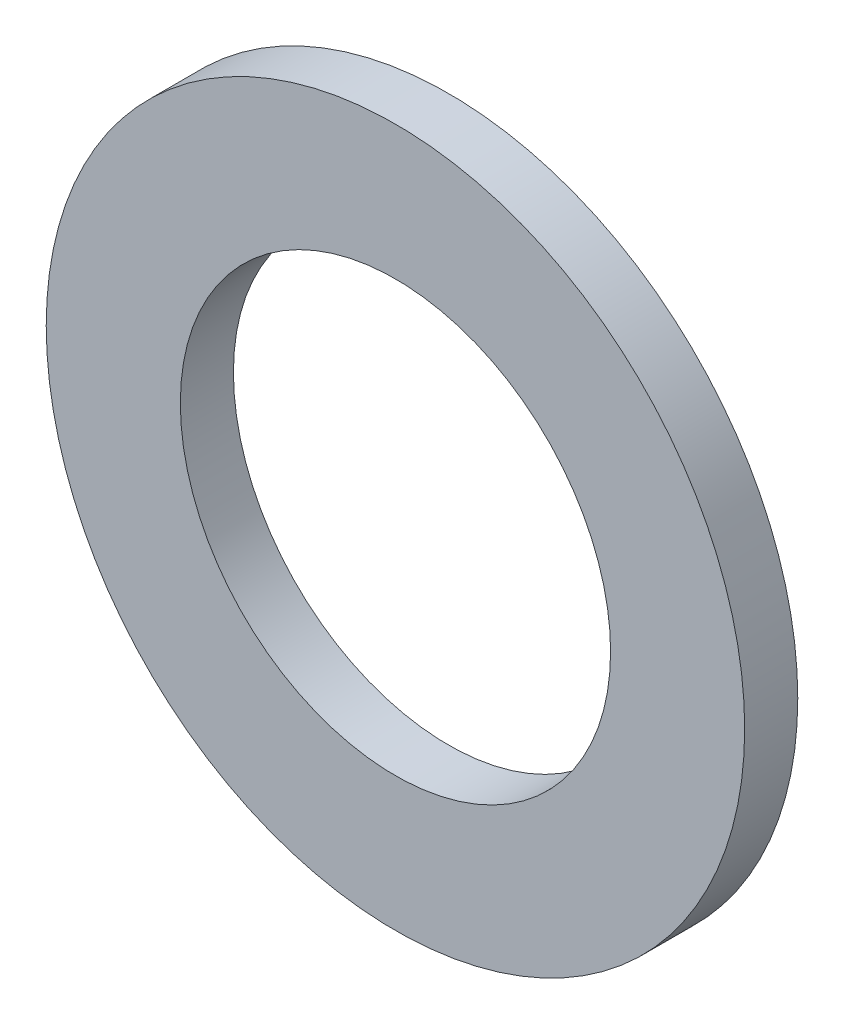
from build123d import *

# Parameters (mm, degrees)
SKETCH1_R      = 15.875
SKETCH1_R_2    = 9.779
EXTRUDE1_DEPTH = 2.413


with BuildPart() as part:
    # Sketch1 → Extrude1 (new body)
    with BuildSketch(Plane.XY):
        Circle(SKETCH1_R)
        Circle(SKETCH1_R_2, mode=Mode.SUBTRACT)
    extrude(amount=EXTRUDE1_DEPTH)


solid = part.part
